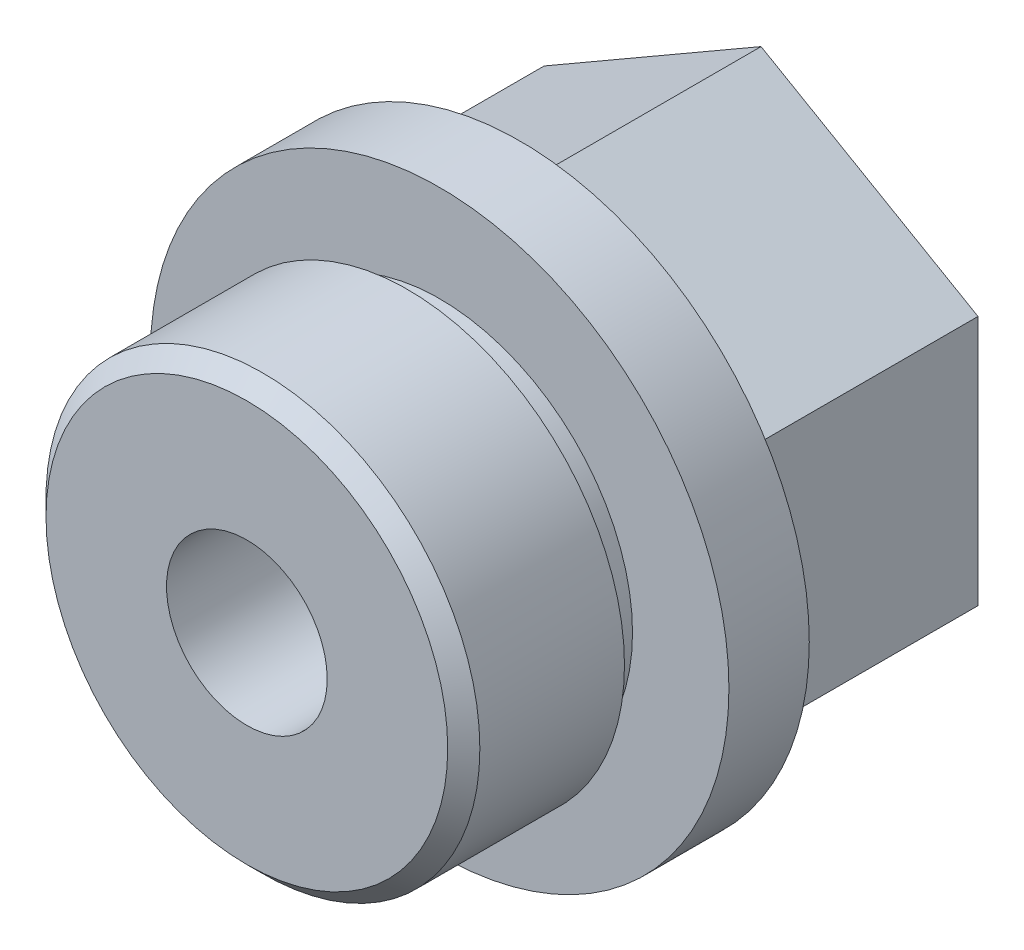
from build123d import *

# Parameters (mm, degrees)
EXTRUDE_1_DEPTH = 15
SKETCH_2_R      = 18
EXTRUDE_2_DEPTH = 5
SKETCH_3_R      = 12
EXTRUDE_3_DEPTH = 2
SKETCH_4_R      = 13.5
EXTRUDE_4_DEPTH = 10
CHAMFER_1_SIZE  = 1


with BuildPart() as part:
    # Sketch 1 → Extrude 1 (new body)
    with BuildSketch(Plane.XY):
        Polygon((0, -15.588457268), (13.5, -7.794228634), (13.5, 7.794228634), (0, 15.588457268), (-13.5, 7.794228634), (-13.5, -7.794228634), align=None)
    extrude(amount=EXTRUDE_1_DEPTH)

    # Sketch 2 → Extrude 2 (add)
    with BuildSketch(Plane.XY.offset(15)):
        Circle(SKETCH_2_R)
    extrude(amount=EXTRUDE_2_DEPTH)

    # Sketch 3 → Extrude 3 (add)
    with BuildSketch(Plane.XY.offset(20)):
        Circle(SKETCH_3_R)
    extrude(amount=EXTRUDE_3_DEPTH)

    # Sketch 4 → Extrude 4 (add)
    with BuildSketch(Plane.XY.offset(22)):
        Circle(SKETCH_4_R)
    extrude(amount=EXTRUDE_4_DEPTH)

    # Chamfer 1
    chamfer_1_edges = [part.edges().sort_by_distance(p)[0] for p in [
        (-13.5, 0, 32),
    ]]
    chamfer(chamfer_1_edges, length=CHAMFER_1_SIZE)

    # Sketch 5 → Cut-Revolve 1 (revolve, cut)
    with BuildSketch(Plane(origin=(0, 0, 0), x_dir=(0, 0, -1), z_dir=(1, 0, 0)), mode=Mode.PRIVATE) as cut_revolve_1_sk:
        Polygon((-32.941176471, 0), (-32.941176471, 5), (-32, 5), (-12, 5), (-9.113248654, 0), align=None)
    revolve(cut_revolve_1_sk.sketch.rotate(Axis((0, 0, 38.776470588), (0, 0, -1)), 90), axis=Axis((0, 0, 38.776470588), (0, 0, -1)), mode=Mode.SUBTRACT)


solid = part.part
